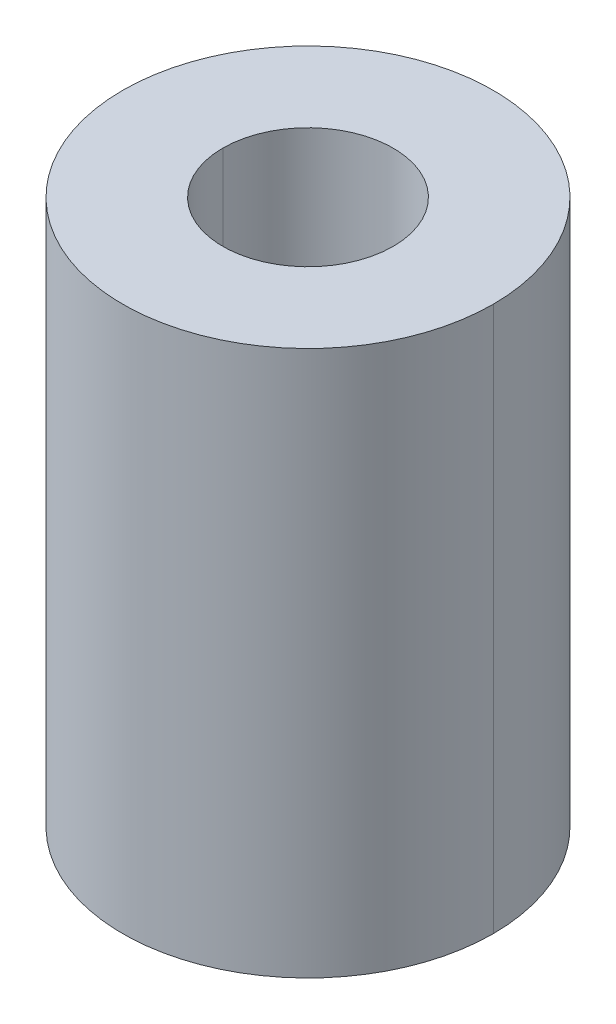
ISO-10303-21;
HEADER;
FILE_DESCRIPTION(('STEP AP214'),'2;1');
FILE_NAME('part.step','',(''),(''),'','','');
FILE_SCHEMA(('AUTOMOTIVE_DESIGN { 1 0 10303 214 1 1 1 1 }'));
ENDSEC;
DATA;
#1=APPLICATION_CONTEXT('core data for automotive mechanical design processes');
#2=APPLICATION_PROTOCOL_DEFINITION('international standard','automotive_design',2000,#1);
#3=PRODUCT_CONTEXT('',#1,'mechanical');
#4=PRODUCT('Part','Part','',(#3));
#5=PRODUCT_RELATED_PRODUCT_CATEGORY('part','',(#4));
#6=PRODUCT_DEFINITION_FORMATION('','',#4);
#7=PRODUCT_DEFINITION_CONTEXT('part definition',#1,'design');
#8=PRODUCT_DEFINITION('design','',#6,#7);
#9=PRODUCT_DEFINITION_SHAPE('','',#8);
#10=(LENGTH_UNIT() NAMED_UNIT(*) SI_UNIT(.MILLI.,.METRE.));
#11=(NAMED_UNIT(*) PLANE_ANGLE_UNIT() SI_UNIT($,.RADIAN.));
#12=(NAMED_UNIT(*) SI_UNIT($,.STERADIAN.) SOLID_ANGLE_UNIT());
#13=UNCERTAINTY_MEASURE_WITH_UNIT(LENGTH_MEASURE(1.E-05),#10,'distance_accuracy_value','');
#14=(GEOMETRIC_REPRESENTATION_CONTEXT(3) GLOBAL_UNCERTAINTY_ASSIGNED_CONTEXT((#13)) GLOBAL_UNIT_ASSIGNED_CONTEXT((#10,
#11,#12)) REPRESENTATION_CONTEXT('',''));
#15=CARTESIAN_POINT('',(0.,0.,0.));
#16=DIRECTION('',(0.,0.,1.));
#17=DIRECTION('',(1.,0.,0.));
#18=AXIS2_PLACEMENT_3D('',#15,#16,#17);
#19=CARTESIAN_POINT('',(0.,-6.35,0.));
#20=DIRECTION('',(0.,1.,0.));
#21=DIRECTION('',(0.,0.,1.));
#22=AXIS2_PLACEMENT_3D('',#19,#20,#21);
#23=PLANE('',#22);
#24=CARTESIAN_POINT('',(0.,-6.35,0.));
#25=DIRECTION('',(0.,-1.,0.));
#26=DIRECTION('',(0.,0.,-1.));
#27=AXIS2_PLACEMENT_3D('',#24,#25,#26);
#28=CIRCLE('',#27,6.35);
#29=CARTESIAN_POINT('',(-6.35,-6.35,0.));
#30=VERTEX_POINT('',#29);
#31=CARTESIAN_POINT('',(6.35,-6.35,0.));
#32=VERTEX_POINT('',#31);
#33=EDGE_CURVE('E66',#30,#32,#28,.T.);
#34=ORIENTED_EDGE('',*,*,#33,.T.);
#35=CARTESIAN_POINT('',(0.,-6.35,0.));
#36=DIRECTION('',(0.,-1.,0.));
#37=DIRECTION('',(0.,0.,-1.));
#38=AXIS2_PLACEMENT_3D('',#35,#36,#37);
#39=CIRCLE('',#38,6.35);
#40=EDGE_CURVE('E19',#32,#30,#39,.T.);
#41=ORIENTED_EDGE('',*,*,#40,.T.);
#42=EDGE_LOOP('',(#34,#41));
#43=FACE_BOUND('',#42,.T.);
#44=ADVANCED_FACE('F16',(#43),#23,.F.);
#45=CARTESIAN_POINT('',(0.,6.35,0.));
#46=DIRECTION('',(0.,-1.,0.));
#47=DIRECTION('',(0.,0.,-1.));
#48=AXIS2_PLACEMENT_3D('',#45,#46,#47);
#49=PLANE('',#48);
#50=CARTESIAN_POINT('',(0.,6.35,0.));
#51=DIRECTION('',(0.,-1.,0.));
#52=DIRECTION('',(0.,0.,-1.));
#53=AXIS2_PLACEMENT_3D('',#50,#51,#52);
#54=CIRCLE('',#53,7.9375);
#55=CARTESIAN_POINT('',(7.9375,6.35,0.));
#56=VERTEX_POINT('',#55);
#57=CARTESIAN_POINT('',(-7.9375,6.35,0.));
#58=VERTEX_POINT('',#57);
#59=EDGE_CURVE('E86',#56,#58,#54,.F.);
#60=ORIENTED_EDGE('',*,*,#59,.T.);
#61=CARTESIAN_POINT('',(0.,6.35,0.));
#62=DIRECTION('',(0.,-1.,0.));
#63=DIRECTION('',(0.,0.,-1.));
#64=AXIS2_PLACEMENT_3D('',#61,#62,#63);
#65=CIRCLE('',#64,7.9375);
#66=EDGE_CURVE('E82',#58,#56,#65,.F.);
#67=ORIENTED_EDGE('',*,*,#66,.T.);
#68=EDGE_LOOP('',(#60,#67));
#69=FACE_BOUND('',#68,.T.);
#70=ADVANCED_FACE('F149',(#69),#49,.F.);
#71=CARTESIAN_POINT('',(0.,-15.875,0.));
#72=DIRECTION('',(0.,-1.,0.));
#73=DIRECTION('',(0.,0.,-1.));
#74=AXIS2_PLACEMENT_3D('',#71,#72,#73);
#75=CYLINDRICAL_SURFACE('',#74,6.35);
#76=CARTESIAN_POINT('',(0.,-25.4,0.));
#77=DIRECTION('',(0.,-1.,0.));
#78=DIRECTION('',(0.,0.,-1.));
#79=AXIS2_PLACEMENT_3D('',#76,#77,#78);
#80=CIRCLE('',#79,6.35);
#81=CARTESIAN_POINT('',(-6.35,-25.4,0.));
#82=VERTEX_POINT('',#81);
#83=CARTESIAN_POINT('',(6.35,-25.4,0.));
#84=VERTEX_POINT('',#83);
#85=EDGE_CURVE('E75',#82,#84,#80,.F.);
#86=ORIENTED_EDGE('',*,*,#85,.F.);
#87=DIRECTION('',(0.,-1.,0.));
#88=VECTOR('',#87,1.);
#89=CARTESIAN_POINT('',(-6.35,-15.875,0.));
#90=LINE('',#89,#88);
#91=EDGE_CURVE('E71',#82,#30,#90,.F.);
#92=ORIENTED_EDGE('',*,*,#91,.T.);
#93=ORIENTED_EDGE('',*,*,#40,.F.);
#94=DIRECTION('',(0.,-1.,0.));
#95=VECTOR('',#94,1.);
#96=CARTESIAN_POINT('',(6.35,-15.875,0.));
#97=LINE('',#96,#95);
#98=EDGE_CURVE('E81',#32,#84,#97,.T.);
#99=ORIENTED_EDGE('',*,*,#98,.T.);
#100=EDGE_LOOP('',(#86,#92,#93,#99));
#101=FACE_BOUND('',#100,.T.);
#102=ADVANCED_FACE('F73',(#101),#75,.F.);
#103=CARTESIAN_POINT('',(0.,-15.875,0.));
#104=DIRECTION('',(0.,-1.,0.));
#105=DIRECTION('',(0.,0.,-1.));
#106=AXIS2_PLACEMENT_3D('',#103,#104,#105);
#107=CYLINDRICAL_SURFACE('',#106,6.35);
#108=ORIENTED_EDGE('',*,*,#33,.F.);
#109=ORIENTED_EDGE('',*,*,#91,.F.);
#110=CARTESIAN_POINT('',(0.,-25.4,0.));
#111=DIRECTION('',(0.,-1.,0.));
#112=DIRECTION('',(0.,0.,-1.));
#113=AXIS2_PLACEMENT_3D('',#110,#111,#112);
#114=CIRCLE('',#113,6.35);
#115=EDGE_CURVE('E90',#84,#82,#114,.F.);
#116=ORIENTED_EDGE('',*,*,#115,.F.);
#117=ORIENTED_EDGE('',*,*,#98,.F.);
#118=EDGE_LOOP('',(#108,#109,#116,#117));
#119=FACE_BOUND('',#118,.T.);
#120=ADVANCED_FACE('F80',(#119),#107,.F.);
#121=CARTESIAN_POINT('',(0.,15.875,0.));
#122=DIRECTION('',(0.,-1.,0.));
#123=DIRECTION('',(0.,0.,-1.));
#124=AXIS2_PLACEMENT_3D('',#121,#122,#123);
#125=CYLINDRICAL_SURFACE('',#124,7.9375);
#126=ORIENTED_EDGE('',*,*,#66,.F.);
#127=DIRECTION('',(0.,-1.,0.));
#128=VECTOR('',#127,1.);
#129=CARTESIAN_POINT('',(-7.9375,15.875,0.));
#130=LINE('',#129,#128);
#131=CARTESIAN_POINT('',(-7.9375,25.4,0.));
#132=VERTEX_POINT('',#131);
#133=EDGE_CURVE('E88',#58,#132,#130,.F.);
#134=ORIENTED_EDGE('',*,*,#133,.T.);
#135=CARTESIAN_POINT('',(0.,25.4,0.));
#136=DIRECTION('',(0.,-1.,0.));
#137=DIRECTION('',(0.,0.,-1.));
#138=AXIS2_PLACEMENT_3D('',#135,#136,#137);
#139=CIRCLE('',#138,7.9375);
#140=CARTESIAN_POINT('',(7.9375,25.4,0.));
#141=VERTEX_POINT('',#140);
#142=EDGE_CURVE('E95',#141,#132,#139,.T.);
#143=ORIENTED_EDGE('',*,*,#142,.F.);
#144=DIRECTION('',(0.,-1.,0.));
#145=VECTOR('',#144,1.);
#146=CARTESIAN_POINT('',(7.9375,15.875,0.));
#147=LINE('',#146,#145);
#148=EDGE_CURVE('E91',#141,#56,#147,.T.);
#149=ORIENTED_EDGE('',*,*,#148,.T.);
#150=EDGE_LOOP('',(#126,#134,#143,#149));
#151=FACE_BOUND('',#150,.T.);
#152=ADVANCED_FACE('F129',(#151),#125,.F.);
#153=CARTESIAN_POINT('',(0.,15.875,0.));
#154=DIRECTION('',(0.,-1.,0.));
#155=DIRECTION('',(0.,0.,-1.));
#156=AXIS2_PLACEMENT_3D('',#153,#154,#155);
#157=CYLINDRICAL_SURFACE('',#156,7.9375);
#158=CARTESIAN_POINT('',(0.,25.4,0.));
#159=DIRECTION('',(0.,-1.,0.));
#160=DIRECTION('',(0.,0.,-1.));
#161=AXIS2_PLACEMENT_3D('',#158,#159,#160);
#162=CIRCLE('',#161,7.9375);
#163=EDGE_CURVE('E98',#132,#141,#162,.T.);
#164=ORIENTED_EDGE('',*,*,#163,.F.);
#165=ORIENTED_EDGE('',*,*,#133,.F.);
#166=ORIENTED_EDGE('',*,*,#59,.F.);
#167=ORIENTED_EDGE('',*,*,#148,.F.);
#168=EDGE_LOOP('',(#164,#165,#166,#167));
#169=FACE_BOUND('',#168,.T.);
#170=ADVANCED_FACE('F120',(#169),#157,.F.);
#171=CARTESIAN_POINT('',(0.,-25.4,0.));
#172=DIRECTION('',(0.,-1.,0.));
#173=DIRECTION('',(0.,0.,-1.));
#174=AXIS2_PLACEMENT_3D('',#171,#172,#173);
#175=PLANE('',#174);
#176=CARTESIAN_POINT('',(0.,-25.4,0.));
#177=DIRECTION('',(0.,-1.,0.));
#178=DIRECTION('',(0.,0.,-1.));
#179=AXIS2_PLACEMENT_3D('',#176,#177,#178);
#180=CIRCLE('',#179,17.2640625);
#181=CARTESIAN_POINT('',(17.2640625,-25.4,0.));
#182=VERTEX_POINT('',#181);
#183=CARTESIAN_POINT('',(-17.2640625,-25.4,0.));
#184=VERTEX_POINT('',#183);
#185=EDGE_CURVE('E103',#182,#184,#180,.F.);
#186=ORIENTED_EDGE('',*,*,#185,.F.);
#187=CARTESIAN_POINT('',(0.,-25.4,0.));
#188=DIRECTION('',(0.,-1.,0.));
#189=DIRECTION('',(0.,0.,-1.));
#190=AXIS2_PLACEMENT_3D('',#187,#188,#189);
#191=CIRCLE('',#190,17.2640625);
#192=EDGE_CURVE('E93',#184,#182,#191,.F.);
#193=ORIENTED_EDGE('',*,*,#192,.F.);
#194=EDGE_LOOP('',(#186,#193));
#195=FACE_BOUND('',#194,.T.);
#196=ORIENTED_EDGE('',*,*,#85,.T.);
#197=ORIENTED_EDGE('',*,*,#115,.T.);
#198=EDGE_LOOP('',(#196,#197));
#199=FACE_BOUND('',#198,.T.);
#200=ADVANCED_FACE('F117',(#195,#199),#175,.T.);
#201=CARTESIAN_POINT('',(0.,0.,0.));
#202=DIRECTION('',(0.,-1.,0.));
#203=DIRECTION('',(0.,0.,-1.));
#204=AXIS2_PLACEMENT_3D('',#201,#202,#203);
#205=CYLINDRICAL_SURFACE('',#204,17.2640625);
#206=DIRECTION('',(0.,-1.,0.));
#207=VECTOR('',#206,1.);
#208=CARTESIAN_POINT('',(-17.2640625,0.,0.));
#209=LINE('',#208,#207);
#210=CARTESIAN_POINT('',(-17.2640625,25.4,0.));
#211=VERTEX_POINT('',#210);
#212=EDGE_CURVE('E25',#184,#211,#209,.F.);
#213=ORIENTED_EDGE('',*,*,#212,.F.);
#214=ORIENTED_EDGE('',*,*,#192,.T.);
#215=DIRECTION('',(0.,-1.,0.));
#216=VECTOR('',#215,1.);
#217=CARTESIAN_POINT('',(17.2640625,0.,0.));
#218=LINE('',#217,#216);
#219=CARTESIAN_POINT('',(17.2640625,25.4,0.));
#220=VERTEX_POINT('',#219);
#221=EDGE_CURVE('E102',#220,#182,#218,.T.);
#222=ORIENTED_EDGE('',*,*,#221,.F.);
#223=CARTESIAN_POINT('',(0.,25.4,0.));
#224=DIRECTION('',(0.,-1.,0.));
#225=DIRECTION('',(0.,0.,-1.));
#226=AXIS2_PLACEMENT_3D('',#223,#224,#225);
#227=CIRCLE('',#226,17.2640625);
#228=EDGE_CURVE('E34',#211,#220,#227,.F.);
#229=ORIENTED_EDGE('',*,*,#228,.F.);
#230=EDGE_LOOP('',(#213,#214,#222,#229));
#231=FACE_BOUND('',#230,.T.);
#232=ADVANCED_FACE('F115',(#231),#205,.T.);
#233=CARTESIAN_POINT('',(0.,25.4,0.));
#234=DIRECTION('',(0.,1.,0.));
#235=DIRECTION('',(0.,0.,1.));
#236=AXIS2_PLACEMENT_3D('',#233,#234,#235);
#237=PLANE('',#236);
#238=ORIENTED_EDGE('',*,*,#228,.T.);
#239=CARTESIAN_POINT('',(0.,25.4,0.));
#240=DIRECTION('',(0.,-1.,0.));
#241=DIRECTION('',(0.,0.,-1.));
#242=AXIS2_PLACEMENT_3D('',#239,#240,#241);
#243=CIRCLE('',#242,17.2640625);
#244=EDGE_CURVE('E11',#211,#220,#243,.T.);
#245=ORIENTED_EDGE('',*,*,#244,.F.);
#246=EDGE_LOOP('',(#238,#245));
#247=FACE_BOUND('',#246,.T.);
#248=ORIENTED_EDGE('',*,*,#142,.T.);
#249=ORIENTED_EDGE('',*,*,#163,.T.);
#250=EDGE_LOOP('',(#248,#249));
#251=FACE_BOUND('',#250,.T.);
#252=ADVANCED_FACE('F127',(#247,#251),#237,.T.);
#253=CARTESIAN_POINT('',(0.,0.,0.));
#254=DIRECTION('',(0.,-1.,0.));
#255=DIRECTION('',(0.,0.,-1.));
#256=AXIS2_PLACEMENT_3D('',#253,#254,#255);
#257=CYLINDRICAL_SURFACE('',#256,17.2640625);
#258=ORIENTED_EDGE('',*,*,#212,.T.);
#259=ORIENTED_EDGE('',*,*,#244,.T.);
#260=ORIENTED_EDGE('',*,*,#221,.T.);
#261=ORIENTED_EDGE('',*,*,#185,.T.);
#262=EDGE_LOOP('',(#258,#259,#260,#261));
#263=FACE_BOUND('',#262,.T.);
#264=ADVANCED_FACE('F113',(#263),#257,.T.);
#265=CLOSED_SHELL('',(#44,#70,#102,#120,#152,#170,#200,#232,#252,#264));
#266=MANIFOLD_SOLID_BREP('B1',#265);
#267=ADVANCED_BREP_SHAPE_REPRESENTATION('',(#18,#266),#14);
#268=SHAPE_DEFINITION_REPRESENTATION(#9,#267);
ENDSEC;
END-ISO-10303-21;
